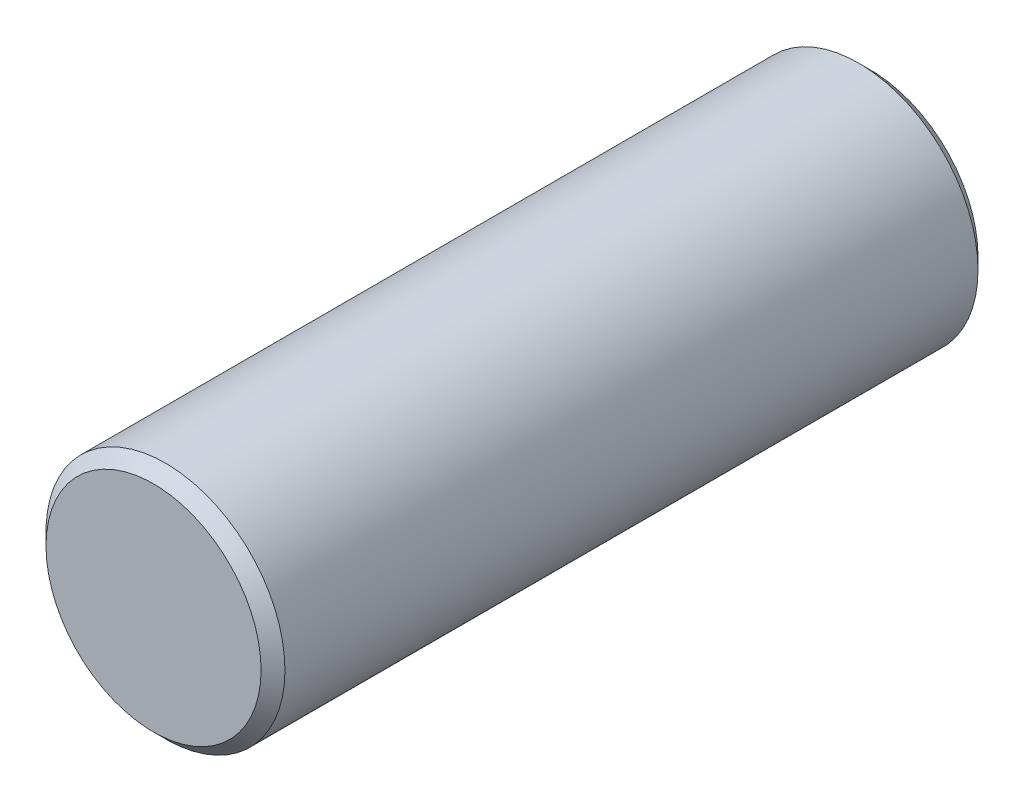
ISO-10303-21;
HEADER;
FILE_DESCRIPTION(('STEP AP214'),'2;1');
FILE_NAME('part.step','',(''),(''),'','','');
FILE_SCHEMA(('AUTOMOTIVE_DESIGN { 1 0 10303 214 1 1 1 1 }'));
ENDSEC;
DATA;
#1=APPLICATION_CONTEXT('core data for automotive mechanical design processes');
#2=APPLICATION_PROTOCOL_DEFINITION('international standard','automotive_design',2000,#1);
#3=PRODUCT_CONTEXT('',#1,'mechanical');
#4=PRODUCT('Part','Part','',(#3));
#5=PRODUCT_RELATED_PRODUCT_CATEGORY('part','',(#4));
#6=PRODUCT_DEFINITION_FORMATION('','',#4);
#7=PRODUCT_DEFINITION_CONTEXT('part definition',#1,'design');
#8=PRODUCT_DEFINITION('design','',#6,#7);
#9=PRODUCT_DEFINITION_SHAPE('','',#8);
#10=(LENGTH_UNIT() NAMED_UNIT(*) SI_UNIT(.MILLI.,.METRE.));
#11=(NAMED_UNIT(*) PLANE_ANGLE_UNIT() SI_UNIT($,.RADIAN.));
#12=(NAMED_UNIT(*) SI_UNIT($,.STERADIAN.) SOLID_ANGLE_UNIT());
#13=UNCERTAINTY_MEASURE_WITH_UNIT(LENGTH_MEASURE(1.E-05),#10,'distance_accuracy_value','');
#14=(GEOMETRIC_REPRESENTATION_CONTEXT(3) GLOBAL_UNCERTAINTY_ASSIGNED_CONTEXT((#13)) GLOBAL_UNIT_ASSIGNED_CONTEXT((#10,
#11,#12)) REPRESENTATION_CONTEXT('',''));
#15=CARTESIAN_POINT('',(0.,0.,0.));
#16=DIRECTION('',(0.,0.,1.));
#17=DIRECTION('',(1.,0.,0.));
#18=AXIS2_PLACEMENT_3D('',#15,#16,#17);
#19=CARTESIAN_POINT('',(0.,0.,3.));
#20=DIRECTION('',(0.,0.,-1.));
#21=DIRECTION('',(-1.,0.,0.));
#22=AXIS2_PLACEMENT_3D('',#19,#20,#21);
#23=CYLINDRICAL_SURFACE('',#22,1.);
#24=CARTESIAN_POINT('',(0.,0.,2.9));
#25=DIRECTION('',(0.,0.,1.));
#26=DIRECTION('',(1.,0.,0.));
#27=AXIS2_PLACEMENT_3D('',#24,#25,#26);
#28=CIRCLE('',#27,1.);
#29=CARTESIAN_POINT('',(1.,0.,2.9));
#30=VERTEX_POINT('',#29);
#31=EDGE_CURVE('E354',#30,#30,#28,.F.);
#32=ORIENTED_EDGE('',*,*,#31,.T.);
#33=EDGE_LOOP('',(#32));
#34=FACE_BOUND('',#33,.T.);
#35=CARTESIAN_POINT('',(0.,0.,-2.9));
#36=DIRECTION('',(0.,0.,1.));
#37=DIRECTION('',(1.,0.,0.));
#38=AXIS2_PLACEMENT_3D('',#35,#36,#37);
#39=CIRCLE('',#38,1.);
#40=CARTESIAN_POINT('',(1.,0.,-2.9));
#41=VERTEX_POINT('',#40);
#42=EDGE_CURVE('E358',#41,#41,#39,.T.);
#43=ORIENTED_EDGE('',*,*,#42,.T.);
#44=EDGE_LOOP('',(#43));
#45=FACE_BOUND('',#44,.T.);
#46=ADVANCED_FACE('F348',(#34,#45),#23,.T.);
#47=CARTESIAN_POINT('',(0.,0.,3.));
#48=DIRECTION('',(0.,0.,1.));
#49=DIRECTION('',(1.,0.,0.));
#50=AXIS2_PLACEMENT_3D('',#47,#48,#49);
#51=PLANE('',#50);
#52=CARTESIAN_POINT('',(0.,0.,3.));
#53=DIRECTION('',(0.,0.,1.));
#54=DIRECTION('',(1.,0.,0.));
#55=AXIS2_PLACEMENT_3D('',#52,#53,#54);
#56=CIRCLE('',#55,0.899999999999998);
#57=CARTESIAN_POINT('',(0.899999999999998,0.,3.));
#58=VERTEX_POINT('',#57);
#59=EDGE_CURVE('E362',#58,#58,#56,.T.);
#60=ORIENTED_EDGE('',*,*,#59,.T.);
#61=EDGE_LOOP('',(#60));
#62=FACE_BOUND('',#61,.T.);
#63=ADVANCED_FACE('F368',(#62),#51,.T.);
#64=CARTESIAN_POINT('',(0.,0.,-3.));
#65=DIRECTION('',(0.,0.,1.));
#66=DIRECTION('',(1.,0.,0.));
#67=AXIS2_PLACEMENT_3D('',#64,#65,#66);
#68=PLANE('',#67);
#69=CARTESIAN_POINT('',(0.,0.,-3.));
#70=DIRECTION('',(0.,0.,1.));
#71=DIRECTION('',(1.,0.,0.));
#72=AXIS2_PLACEMENT_3D('',#69,#70,#71);
#73=CIRCLE('',#72,0.899999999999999);
#74=CARTESIAN_POINT('',(0.899999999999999,0.,-3.));
#75=VERTEX_POINT('',#74);
#76=EDGE_CURVE('E10',#75,#75,#73,.F.);
#77=ORIENTED_EDGE('',*,*,#76,.T.);
#78=EDGE_LOOP('',(#77));
#79=FACE_BOUND('',#78,.T.);
#80=ADVANCED_FACE('F373',(#79),#68,.F.);
#81=CARTESIAN_POINT('',(0.,0.,3.));
#82=DIRECTION('',(0.,0.,-1.));
#83=DIRECTION('',(-1.,0.,0.));
#84=AXIS2_PLACEMENT_3D('',#81,#82,#83);
#85=CONICAL_SURFACE('',#84,0.899999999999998,0.785398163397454);
#86=ORIENTED_EDGE('',*,*,#31,.F.);
#87=EDGE_LOOP('',(#86));
#88=FACE_BOUND('',#87,.T.);
#89=ORIENTED_EDGE('',*,*,#59,.F.);
#90=EDGE_LOOP('',(#89));
#91=FACE_BOUND('',#90,.T.);
#92=ADVANCED_FACE('F370',(#88,#91),#85,.T.);
#93=CARTESIAN_POINT('',(0.,0.,-2.9));
#94=DIRECTION('',(0.,0.,1.));
#95=DIRECTION('',(1.,0.,0.));
#96=AXIS2_PLACEMENT_3D('',#93,#94,#95);
#97=CONICAL_SURFACE('',#96,1.,0.785398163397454);
#98=ORIENTED_EDGE('',*,*,#76,.F.);
#99=EDGE_LOOP('',(#98));
#100=FACE_BOUND('',#99,.T.);
#101=ORIENTED_EDGE('',*,*,#42,.F.);
#102=EDGE_LOOP('',(#101));
#103=FACE_BOUND('',#102,.T.);
#104=ADVANCED_FACE('F372',(#100,#103),#97,.T.);
#105=CLOSED_SHELL('',(#46,#63,#80,#92,#104));
#106=MANIFOLD_SOLID_BREP('B2',#105);
#107=ADVANCED_BREP_SHAPE_REPRESENTATION('',(#18,#106),#14);
#108=SHAPE_DEFINITION_REPRESENTATION(#9,#107);
ENDSEC;
END-ISO-10303-21;
